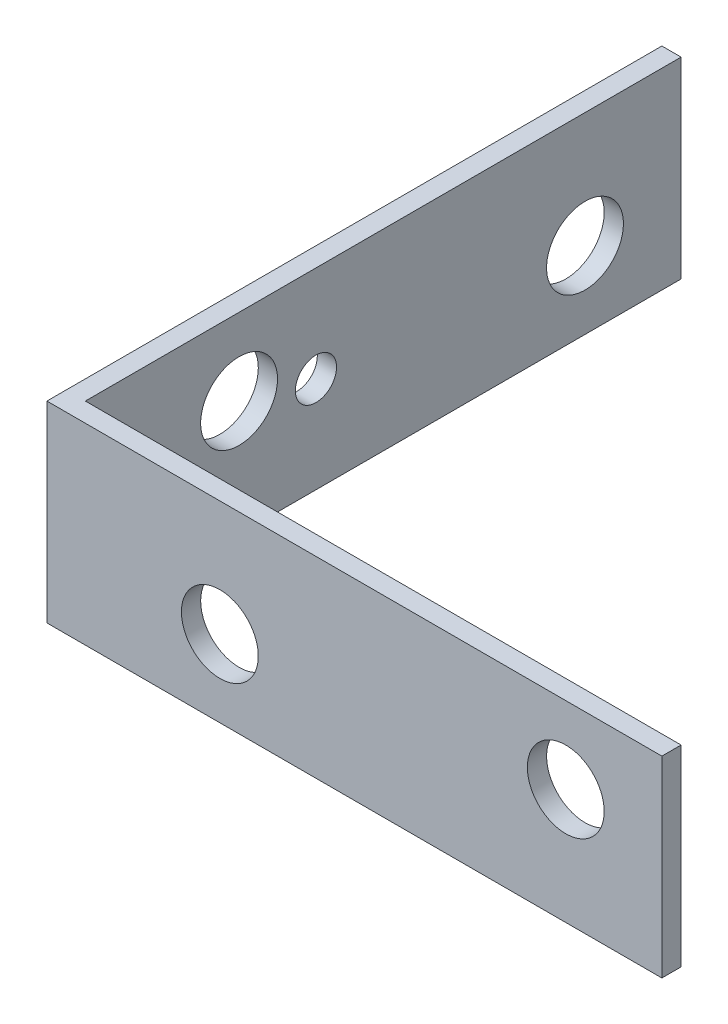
ISO-10303-21;
HEADER;
FILE_DESCRIPTION(('STEP AP214'),'2;1');
FILE_NAME('part.step','',(''),(''),'','','');
FILE_SCHEMA(('AUTOMOTIVE_DESIGN { 1 0 10303 214 1 1 1 1 }'));
ENDSEC;
DATA;
#1=APPLICATION_CONTEXT('core data for automotive mechanical design processes');
#2=APPLICATION_PROTOCOL_DEFINITION('international standard','automotive_design',2000,#1);
#3=PRODUCT_CONTEXT('',#1,'mechanical');
#4=PRODUCT('Part','Part','',(#3));
#5=PRODUCT_RELATED_PRODUCT_CATEGORY('part','',(#4));
#6=PRODUCT_DEFINITION_FORMATION('','',#4);
#7=PRODUCT_DEFINITION_CONTEXT('part definition',#1,'design');
#8=PRODUCT_DEFINITION('design','',#6,#7);
#9=PRODUCT_DEFINITION_SHAPE('','',#8);
#10=(LENGTH_UNIT() NAMED_UNIT(*) SI_UNIT(.MILLI.,.METRE.));
#11=(NAMED_UNIT(*) PLANE_ANGLE_UNIT() SI_UNIT($,.RADIAN.));
#12=(NAMED_UNIT(*) SI_UNIT($,.STERADIAN.) SOLID_ANGLE_UNIT());
#13=UNCERTAINTY_MEASURE_WITH_UNIT(LENGTH_MEASURE(1.E-05),#10,'distance_accuracy_value','');
#14=(GEOMETRIC_REPRESENTATION_CONTEXT(3) GLOBAL_UNCERTAINTY_ASSIGNED_CONTEXT((#13)) GLOBAL_UNIT_ASSIGNED_CONTEXT((#10,
#11,#12)) REPRESENTATION_CONTEXT('',''));
#15=CARTESIAN_POINT('',(0.,0.,0.));
#16=DIRECTION('',(0.,0.,1.));
#17=DIRECTION('',(1.,0.,0.));
#18=AXIS2_PLACEMENT_3D('',#15,#16,#17);
#19=CARTESIAN_POINT('',(0.,15.875,0.));
#20=DIRECTION('',(-1.,0.,0.));
#21=DIRECTION('',(0.,0.,1.));
#22=AXIS2_PLACEMENT_3D('',#19,#20,#21);
#23=PLANE('',#22);
#24=DIRECTION('',(0.,0.,-1.));
#25=VECTOR('',#24,1.);
#26=CARTESIAN_POINT('',(0.,0.,0.));
#27=LINE('',#26,#25);
#28=CARTESIAN_POINT('',(0.,0.,0.));
#29=VERTEX_POINT('',#28);
#30=CARTESIAN_POINT('',(0.,0.,-1.5875));
#31=VERTEX_POINT('',#30);
#32=EDGE_CURVE('E115',#29,#31,#27,.T.);
#33=ORIENTED_EDGE('',*,*,#32,.T.);
#34=DIRECTION('',(0.,-1.,0.));
#35=VECTOR('',#34,1.);
#36=CARTESIAN_POINT('',(0.,15.875,-1.5875));
#37=LINE('',#36,#35);
#38=CARTESIAN_POINT('',(0.,15.875,-1.5875));
#39=VERTEX_POINT('',#38);
#40=EDGE_CURVE('E11',#39,#31,#37,.T.);
#41=ORIENTED_EDGE('',*,*,#40,.F.);
#42=DIRECTION('',(0.,0.,-1.));
#43=VECTOR('',#42,1.);
#44=CARTESIAN_POINT('',(0.,15.875,0.));
#45=LINE('',#44,#43);
#46=CARTESIAN_POINT('',(0.,15.875,0.));
#47=VERTEX_POINT('',#46);
#48=EDGE_CURVE('E126',#47,#39,#45,.T.);
#49=ORIENTED_EDGE('',*,*,#48,.F.);
#50=DIRECTION('',(0.,-1.,0.));
#51=VECTOR('',#50,1.);
#52=CARTESIAN_POINT('',(0.,15.875,0.));
#53=LINE('',#52,#51);
#54=EDGE_CURVE('E111',#47,#29,#53,.T.);
#55=ORIENTED_EDGE('',*,*,#54,.T.);
#56=EDGE_LOOP('',(#33,#41,#49,#55));
#57=FACE_BOUND('',#56,.T.);
#58=ADVANCED_FACE('F31',(#57),#23,.F.);
#59=CARTESIAN_POINT('',(0.,15.875,-1.5875));
#60=DIRECTION('',(0.,0.,1.));
#61=DIRECTION('',(1.,0.,0.));
#62=AXIS2_PLACEMENT_3D('',#59,#60,#61);
#63=PLANE('',#62);
#64=CARTESIAN_POINT('',(-36.5125,6.35,-1.5875));
#65=DIRECTION('',(0.,0.,-1.));
#66=DIRECTION('',(-1.,0.,0.));
#67=AXIS2_PLACEMENT_3D('',#64,#65,#66);
#68=CIRCLE('',#67,3.175);
#69=CARTESIAN_POINT('',(-39.6875,6.35,-1.5875));
#70=VERTEX_POINT('',#69);
#71=EDGE_CURVE('E270',#70,#70,#68,.T.);
#72=ORIENTED_EDGE('',*,*,#71,.F.);
#73=EDGE_LOOP('',(#72));
#74=FACE_BOUND('',#73,.T.);
#75=CARTESIAN_POINT('',(-7.9375,9.525,-1.5875));
#76=DIRECTION('',(0.,0.,-1.));
#77=DIRECTION('',(-1.,0.,0.));
#78=AXIS2_PLACEMENT_3D('',#75,#76,#77);
#79=CIRCLE('',#78,3.175);
#80=CARTESIAN_POINT('',(-11.1125,9.525,-1.5875));
#81=VERTEX_POINT('',#80);
#82=EDGE_CURVE('E266',#81,#81,#79,.T.);
#83=ORIENTED_EDGE('',*,*,#82,.F.);
#84=EDGE_LOOP('',(#83));
#85=FACE_BOUND('',#84,.T.);
#86=DIRECTION('',(-1.,0.,0.));
#87=VECTOR('',#86,1.);
#88=CARTESIAN_POINT('',(0.,0.,-1.5875));
#89=LINE('',#88,#87);
#90=CARTESIAN_POINT('',(-49.2125,0.,-1.5875));
#91=VERTEX_POINT('',#90);
#92=EDGE_CURVE('E118',#31,#91,#89,.T.);
#93=ORIENTED_EDGE('',*,*,#92,.T.);
#94=DIRECTION('',(0.,-1.,0.));
#95=VECTOR('',#94,1.);
#96=CARTESIAN_POINT('',(-49.2125,15.875,-1.5875));
#97=LINE('',#96,#95);
#98=CARTESIAN_POINT('',(-49.2125,15.875,-1.5875));
#99=VERTEX_POINT('',#98);
#100=EDGE_CURVE('E39',#99,#91,#97,.T.);
#101=ORIENTED_EDGE('',*,*,#100,.F.);
#102=DIRECTION('',(-1.,0.,0.));
#103=VECTOR('',#102,1.);
#104=CARTESIAN_POINT('',(0.,15.875,-1.5875));
#105=LINE('',#104,#103);
#106=EDGE_CURVE('E84',#39,#99,#105,.T.);
#107=ORIENTED_EDGE('',*,*,#106,.F.);
#108=ORIENTED_EDGE('',*,*,#40,.T.);
#109=EDGE_LOOP('',(#93,#101,#107,#108));
#110=FACE_BOUND('',#109,.T.);
#111=ADVANCED_FACE('F154',(#74,#85,#110),#63,.F.);
#112=CARTESIAN_POINT('',(-49.2125,15.875,-50.8));
#113=DIRECTION('',(-1.,0.,0.));
#114=DIRECTION('',(0.,0.,1.));
#115=AXIS2_PLACEMENT_3D('',#112,#113,#114);
#116=PLANE('',#115);
#117=CARTESIAN_POINT('',(-49.2125,7.9375,-20.6375));
#118=DIRECTION('',(1.,0.,0.));
#119=DIRECTION('',(0.,0.,-1.));
#120=AXIS2_PLACEMENT_3D('',#117,#118,#119);
#121=CIRCLE('',#120,1.7);
#122=CARTESIAN_POINT('',(-49.2125,7.9375,-22.3375));
#123=VERTEX_POINT('',#122);
#124=EDGE_CURVE('E290',#123,#123,#121,.T.);
#125=ORIENTED_EDGE('',*,*,#124,.F.);
#126=EDGE_LOOP('',(#125));
#127=FACE_BOUND('',#126,.T.);
#128=CARTESIAN_POINT('',(-49.2125,9.525,-14.2875));
#129=DIRECTION('',(1.,0.,0.));
#130=DIRECTION('',(0.,0.,-1.));
#131=AXIS2_PLACEMENT_3D('',#128,#129,#130);
#132=CIRCLE('',#131,3.175);
#133=CARTESIAN_POINT('',(-49.2125,9.525,-17.4625));
#134=VERTEX_POINT('',#133);
#135=EDGE_CURVE('E284',#134,#134,#132,.T.);
#136=ORIENTED_EDGE('',*,*,#135,.F.);
#137=EDGE_LOOP('',(#136));
#138=FACE_BOUND('',#137,.T.);
#139=CARTESIAN_POINT('',(-49.2125,6.35,-42.8625));
#140=DIRECTION('',(1.,0.,0.));
#141=DIRECTION('',(0.,0.,-1.));
#142=AXIS2_PLACEMENT_3D('',#139,#140,#141);
#143=CIRCLE('',#142,3.175);
#144=CARTESIAN_POINT('',(-49.2125,6.35,-46.0375));
#145=VERTEX_POINT('',#144);
#146=EDGE_CURVE('E278',#145,#145,#143,.T.);
#147=ORIENTED_EDGE('',*,*,#146,.F.);
#148=EDGE_LOOP('',(#147));
#149=FACE_BOUND('',#148,.T.);
#150=DIRECTION('',(0.,0.,-1.));
#151=VECTOR('',#150,1.);
#152=CARTESIAN_POINT('',(-49.2125,0.,-50.8));
#153=LINE('',#152,#151);
#154=CARTESIAN_POINT('',(-49.2125,0.,-50.8));
#155=VERTEX_POINT('',#154);
#156=EDGE_CURVE('E121',#91,#155,#153,.T.);
#157=ORIENTED_EDGE('',*,*,#156,.T.);
#158=DIRECTION('',(0.,-1.,0.));
#159=VECTOR('',#158,1.);
#160=CARTESIAN_POINT('',(-49.2125,15.875,-50.8));
#161=LINE('',#160,#159);
#162=CARTESIAN_POINT('',(-49.2125,15.875,-50.8));
#163=VERTEX_POINT('',#162);
#164=EDGE_CURVE('E106',#163,#155,#161,.T.);
#165=ORIENTED_EDGE('',*,*,#164,.F.);
#166=DIRECTION('',(0.,0.,-1.));
#167=VECTOR('',#166,1.);
#168=CARTESIAN_POINT('',(-49.2125,15.875,-50.8));
#169=LINE('',#168,#167);
#170=EDGE_CURVE('E97',#99,#163,#169,.T.);
#171=ORIENTED_EDGE('',*,*,#170,.F.);
#172=ORIENTED_EDGE('',*,*,#100,.T.);
#173=EDGE_LOOP('',(#157,#165,#171,#172));
#174=FACE_BOUND('',#173,.T.);
#175=ADVANCED_FACE('F132',(#127,#138,#149,#174),#116,.F.);
#176=CARTESIAN_POINT('',(-50.8,15.875,-50.8));
#177=DIRECTION('',(0.,0.,1.));
#178=DIRECTION('',(1.,0.,0.));
#179=AXIS2_PLACEMENT_3D('',#176,#177,#178);
#180=PLANE('',#179);
#181=DIRECTION('',(-1.,0.,0.));
#182=VECTOR('',#181,1.);
#183=CARTESIAN_POINT('',(-50.8,0.,-50.8));
#184=LINE('',#183,#182);
#185=CARTESIAN_POINT('',(-50.8,0.,-50.8));
#186=VERTEX_POINT('',#185);
#187=EDGE_CURVE('E105',#155,#186,#184,.T.);
#188=ORIENTED_EDGE('',*,*,#187,.T.);
#189=DIRECTION('',(0.,-1.,0.));
#190=VECTOR('',#189,1.);
#191=CARTESIAN_POINT('',(-50.8,15.875,-50.8));
#192=LINE('',#191,#190);
#193=CARTESIAN_POINT('',(-50.8,15.875,-50.8));
#194=VERTEX_POINT('',#193);
#195=EDGE_CURVE('E102',#194,#186,#192,.T.);
#196=ORIENTED_EDGE('',*,*,#195,.F.);
#197=DIRECTION('',(-1.,0.,0.));
#198=VECTOR('',#197,1.);
#199=CARTESIAN_POINT('',(-50.8,15.875,-50.8));
#200=LINE('',#199,#198);
#201=EDGE_CURVE('E91',#163,#194,#200,.T.);
#202=ORIENTED_EDGE('',*,*,#201,.F.);
#203=ORIENTED_EDGE('',*,*,#164,.T.);
#204=EDGE_LOOP('',(#188,#196,#202,#203));
#205=FACE_BOUND('',#204,.T.);
#206=ADVANCED_FACE('F103',(#205),#180,.F.);
#207=CARTESIAN_POINT('',(-50.8,15.875,0.));
#208=DIRECTION('',(1.,0.,0.));
#209=DIRECTION('',(0.,0.,-1.));
#210=AXIS2_PLACEMENT_3D('',#207,#208,#209);
#211=PLANE('',#210);
#212=CARTESIAN_POINT('',(-50.8,7.9375,-20.6375));
#213=DIRECTION('',(1.,0.,0.));
#214=DIRECTION('',(0.,0.,-1.));
#215=AXIS2_PLACEMENT_3D('',#212,#213,#214);
#216=CIRCLE('',#215,1.7);
#217=CARTESIAN_POINT('',(-50.8,7.9375,-22.3375));
#218=VERTEX_POINT('',#217);
#219=EDGE_CURVE('E287',#218,#218,#216,.T.);
#220=ORIENTED_EDGE('',*,*,#219,.T.);
#221=EDGE_LOOP('',(#220));
#222=FACE_BOUND('',#221,.T.);
#223=CARTESIAN_POINT('',(-50.8,9.525,-14.2875));
#224=DIRECTION('',(1.,0.,0.));
#225=DIRECTION('',(0.,0.,-1.));
#226=AXIS2_PLACEMENT_3D('',#223,#224,#225);
#227=CIRCLE('',#226,3.175);
#228=CARTESIAN_POINT('',(-50.8,9.525,-17.4625));
#229=VERTEX_POINT('',#228);
#230=EDGE_CURVE('E281',#229,#229,#227,.T.);
#231=ORIENTED_EDGE('',*,*,#230,.T.);
#232=EDGE_LOOP('',(#231));
#233=FACE_BOUND('',#232,.T.);
#234=CARTESIAN_POINT('',(-50.8,6.35,-42.8625));
#235=DIRECTION('',(1.,0.,0.));
#236=DIRECTION('',(0.,0.,-1.));
#237=AXIS2_PLACEMENT_3D('',#234,#235,#236);
#238=CIRCLE('',#237,3.175);
#239=CARTESIAN_POINT('',(-50.8,6.35,-46.0375));
#240=VERTEX_POINT('',#239);
#241=EDGE_CURVE('E276',#240,#240,#238,.T.);
#242=ORIENTED_EDGE('',*,*,#241,.T.);
#243=EDGE_LOOP('',(#242));
#244=FACE_BOUND('',#243,.T.);
#245=DIRECTION('',(0.,0.,1.));
#246=VECTOR('',#245,1.);
#247=CARTESIAN_POINT('',(-50.8,0.,0.));
#248=LINE('',#247,#246);
#249=CARTESIAN_POINT('',(-50.8,0.,0.));
#250=VERTEX_POINT('',#249);
#251=EDGE_CURVE('E70',#186,#250,#248,.T.);
#252=ORIENTED_EDGE('',*,*,#251,.T.);
#253=DIRECTION('',(0.,-1.,0.));
#254=VECTOR('',#253,1.);
#255=CARTESIAN_POINT('',(-50.8,15.875,0.));
#256=LINE('',#255,#254);
#257=CARTESIAN_POINT('',(-50.8,15.875,0.));
#258=VERTEX_POINT('',#257);
#259=EDGE_CURVE('E107',#258,#250,#256,.T.);
#260=ORIENTED_EDGE('',*,*,#259,.F.);
#261=DIRECTION('',(0.,0.,1.));
#262=VECTOR('',#261,1.);
#263=CARTESIAN_POINT('',(-50.8,15.875,0.));
#264=LINE('',#263,#262);
#265=EDGE_CURVE('E95',#194,#258,#264,.T.);
#266=ORIENTED_EDGE('',*,*,#265,.F.);
#267=ORIENTED_EDGE('',*,*,#195,.T.);
#268=EDGE_LOOP('',(#252,#260,#266,#267));
#269=FACE_BOUND('',#268,.T.);
#270=ADVANCED_FACE('F109',(#222,#233,#244,#269),#211,.F.);
#271=CARTESIAN_POINT('',(0.,15.875,0.));
#272=DIRECTION('',(0.,0.,-1.));
#273=DIRECTION('',(-1.,0.,0.));
#274=AXIS2_PLACEMENT_3D('',#271,#272,#273);
#275=PLANE('',#274);
#276=CARTESIAN_POINT('',(-36.5125,6.35,0.));
#277=DIRECTION('',(0.,0.,-1.));
#278=DIRECTION('',(-1.,0.,0.));
#279=AXIS2_PLACEMENT_3D('',#276,#277,#278);
#280=CIRCLE('',#279,3.175);
#281=CARTESIAN_POINT('',(-39.6875,6.35,0.));
#282=VERTEX_POINT('',#281);
#283=EDGE_CURVE('E267',#282,#282,#280,.T.);
#284=ORIENTED_EDGE('',*,*,#283,.T.);
#285=EDGE_LOOP('',(#284));
#286=FACE_BOUND('',#285,.T.);
#287=CARTESIAN_POINT('',(-7.9375,9.525,0.));
#288=DIRECTION('',(0.,0.,-1.));
#289=DIRECTION('',(-1.,0.,0.));
#290=AXIS2_PLACEMENT_3D('',#287,#288,#289);
#291=CIRCLE('',#290,3.175);
#292=CARTESIAN_POINT('',(-11.1125,9.525,0.));
#293=VERTEX_POINT('',#292);
#294=EDGE_CURVE('E119',#293,#293,#291,.T.);
#295=ORIENTED_EDGE('',*,*,#294,.T.);
#296=EDGE_LOOP('',(#295));
#297=FACE_BOUND('',#296,.T.);
#298=DIRECTION('',(1.,0.,0.));
#299=VECTOR('',#298,1.);
#300=CARTESIAN_POINT('',(0.,0.,0.));
#301=LINE('',#300,#299);
#302=EDGE_CURVE('E76',#250,#29,#301,.T.);
#303=ORIENTED_EDGE('',*,*,#302,.T.);
#304=ORIENTED_EDGE('',*,*,#54,.F.);
#305=DIRECTION('',(1.,0.,0.));
#306=VECTOR('',#305,1.);
#307=CARTESIAN_POINT('',(0.,15.875,0.));
#308=LINE('',#307,#306);
#309=EDGE_CURVE('E47',#258,#47,#308,.T.);
#310=ORIENTED_EDGE('',*,*,#309,.F.);
#311=ORIENTED_EDGE('',*,*,#259,.T.);
#312=EDGE_LOOP('',(#303,#304,#310,#311));
#313=FACE_BOUND('',#312,.T.);
#314=ADVANCED_FACE('F139',(#286,#297,#313),#275,.F.);
#315=CARTESIAN_POINT('',(0.,15.875,-1.5875));
#316=DIRECTION('',(0.,1.,0.));
#317=DIRECTION('',(0.,0.,1.));
#318=AXIS2_PLACEMENT_3D('',#315,#316,#317);
#319=PLANE('',#318);
#320=ORIENTED_EDGE('',*,*,#48,.T.);
#321=ORIENTED_EDGE('',*,*,#106,.T.);
#322=ORIENTED_EDGE('',*,*,#170,.T.);
#323=ORIENTED_EDGE('',*,*,#201,.T.);
#324=ORIENTED_EDGE('',*,*,#265,.T.);
#325=ORIENTED_EDGE('',*,*,#309,.T.);
#326=EDGE_LOOP('',(#320,#321,#322,#323,#324,#325));
#327=FACE_BOUND('',#326,.T.);
#328=ADVANCED_FACE('F93',(#327),#319,.T.);
#329=CARTESIAN_POINT('',(0.,0.,-1.5875));
#330=DIRECTION('',(0.,1.,0.));
#331=DIRECTION('',(0.,0.,1.));
#332=AXIS2_PLACEMENT_3D('',#329,#330,#331);
#333=PLANE('',#332);
#334=ORIENTED_EDGE('',*,*,#32,.F.);
#335=ORIENTED_EDGE('',*,*,#302,.F.);
#336=ORIENTED_EDGE('',*,*,#251,.F.);
#337=ORIENTED_EDGE('',*,*,#187,.F.);
#338=ORIENTED_EDGE('',*,*,#156,.F.);
#339=ORIENTED_EDGE('',*,*,#92,.F.);
#340=EDGE_LOOP('',(#334,#335,#336,#337,#338,#339));
#341=FACE_BOUND('',#340,.T.);
#342=ADVANCED_FACE('F135',(#341),#333,.F.);
#343=CARTESIAN_POINT('',(-7.9375,9.525,0.));
#344=DIRECTION('',(0.,0.,-1.));
#345=DIRECTION('',(-1.,0.,0.));
#346=AXIS2_PLACEMENT_3D('',#343,#344,#345);
#347=CYLINDRICAL_SURFACE('',#346,3.175);
#348=ORIENTED_EDGE('',*,*,#294,.F.);
#349=EDGE_LOOP('',(#348));
#350=FACE_BOUND('',#349,.T.);
#351=ORIENTED_EDGE('',*,*,#82,.T.);
#352=EDGE_LOOP('',(#351));
#353=FACE_BOUND('',#352,.T.);
#354=ADVANCED_FACE('F215',(#350,#353),#347,.F.);
#355=CARTESIAN_POINT('',(-36.5125,6.35,0.));
#356=DIRECTION('',(0.,0.,-1.));
#357=DIRECTION('',(-1.,0.,0.));
#358=AXIS2_PLACEMENT_3D('',#355,#356,#357);
#359=CYLINDRICAL_SURFACE('',#358,3.175);
#360=ORIENTED_EDGE('',*,*,#283,.F.);
#361=EDGE_LOOP('',(#360));
#362=FACE_BOUND('',#361,.T.);
#363=ORIENTED_EDGE('',*,*,#71,.T.);
#364=EDGE_LOOP('',(#363));
#365=FACE_BOUND('',#364,.T.);
#366=ADVANCED_FACE('F207',(#362,#365),#359,.F.);
#367=CARTESIAN_POINT('',(-50.8,6.35,-42.8625));
#368=DIRECTION('',(1.,0.,0.));
#369=DIRECTION('',(0.,0.,-1.));
#370=AXIS2_PLACEMENT_3D('',#367,#368,#369);
#371=CYLINDRICAL_SURFACE('',#370,3.175);
#372=ORIENTED_EDGE('',*,*,#241,.F.);
#373=EDGE_LOOP('',(#372));
#374=FACE_BOUND('',#373,.T.);
#375=ORIENTED_EDGE('',*,*,#146,.T.);
#376=EDGE_LOOP('',(#375));
#377=FACE_BOUND('',#376,.T.);
#378=ADVANCED_FACE('F200',(#374,#377),#371,.F.);
#379=CARTESIAN_POINT('',(-50.8,9.525,-14.2875));
#380=DIRECTION('',(1.,0.,0.));
#381=DIRECTION('',(0.,0.,-1.));
#382=AXIS2_PLACEMENT_3D('',#379,#380,#381);
#383=CYLINDRICAL_SURFACE('',#382,3.175);
#384=ORIENTED_EDGE('',*,*,#230,.F.);
#385=EDGE_LOOP('',(#384));
#386=FACE_BOUND('',#385,.T.);
#387=ORIENTED_EDGE('',*,*,#135,.T.);
#388=EDGE_LOOP('',(#387));
#389=FACE_BOUND('',#388,.T.);
#390=ADVANCED_FACE('F190',(#386,#389),#383,.F.);
#391=CARTESIAN_POINT('',(-50.8,7.9375,-20.6375));
#392=DIRECTION('',(1.,0.,0.));
#393=DIRECTION('',(0.,0.,-1.));
#394=AXIS2_PLACEMENT_3D('',#391,#392,#393);
#395=CYLINDRICAL_SURFACE('',#394,1.7);
#396=ORIENTED_EDGE('',*,*,#219,.F.);
#397=EDGE_LOOP('',(#396));
#398=FACE_BOUND('',#397,.T.);
#399=ORIENTED_EDGE('',*,*,#124,.T.);
#400=EDGE_LOOP('',(#399));
#401=FACE_BOUND('',#400,.T.);
#402=ADVANCED_FACE('F186',(#398,#401),#395,.F.);
#403=CLOSED_SHELL('',(#58,#111,#175,#206,#270,#314,#328,#342,#354,#366,#378,#390,#402));
#404=MANIFOLD_SOLID_BREP('B2',#403);
#405=ADVANCED_BREP_SHAPE_REPRESENTATION('',(#18,#404),#14);
#406=SHAPE_DEFINITION_REPRESENTATION(#9,#405);
ENDSEC;
END-ISO-10303-21;
